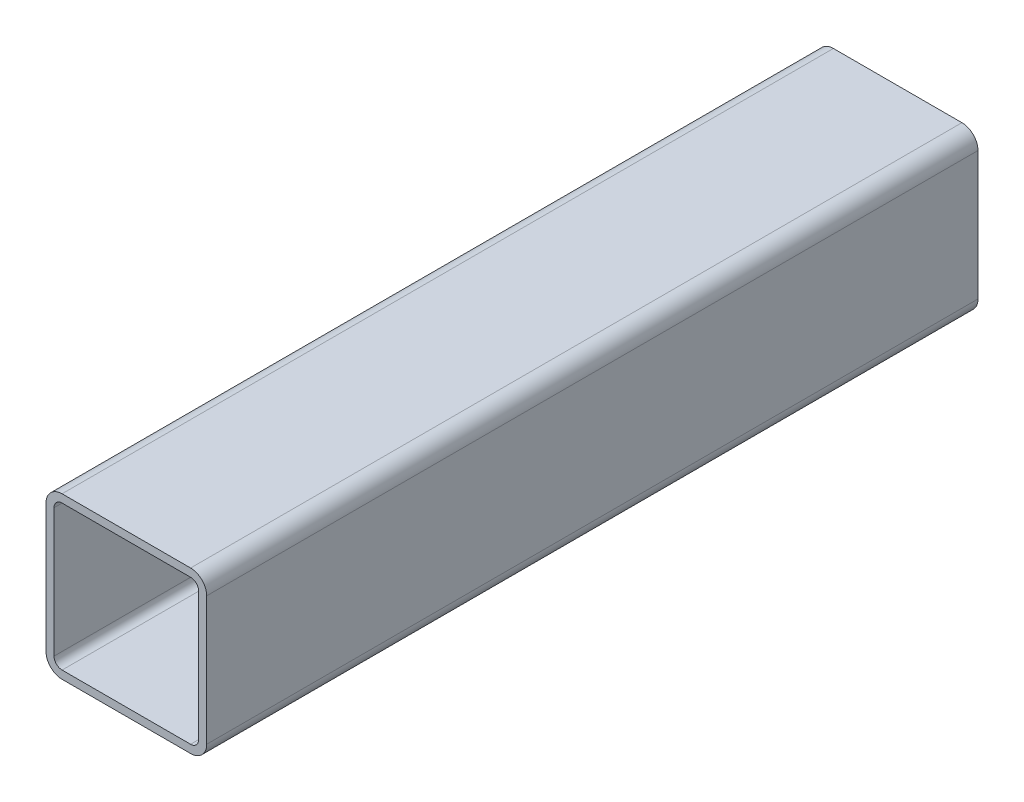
ISO-10303-21;
HEADER;
FILE_DESCRIPTION(('STEP AP214'),'2;1');
FILE_NAME('part.step','',(''),(''),'','','');
FILE_SCHEMA(('AUTOMOTIVE_DESIGN { 1 0 10303 214 1 1 1 1 }'));
ENDSEC;
DATA;
#1=APPLICATION_CONTEXT('core data for automotive mechanical design processes');
#2=APPLICATION_PROTOCOL_DEFINITION('international standard','automotive_design',2000,#1);
#3=PRODUCT_CONTEXT('',#1,'mechanical');
#4=PRODUCT('Part','Part','',(#3));
#5=PRODUCT_RELATED_PRODUCT_CATEGORY('part','',(#4));
#6=PRODUCT_DEFINITION_FORMATION('','',#4);
#7=PRODUCT_DEFINITION_CONTEXT('part definition',#1,'design');
#8=PRODUCT_DEFINITION('design','',#6,#7);
#9=PRODUCT_DEFINITION_SHAPE('','',#8);
#10=(LENGTH_UNIT() NAMED_UNIT(*) SI_UNIT(.MILLI.,.METRE.));
#11=(NAMED_UNIT(*) PLANE_ANGLE_UNIT() SI_UNIT($,.RADIAN.));
#12=(NAMED_UNIT(*) SI_UNIT($,.STERADIAN.) SOLID_ANGLE_UNIT());
#13=UNCERTAINTY_MEASURE_WITH_UNIT(LENGTH_MEASURE(1.E-05),#10,'distance_accuracy_value','');
#14=(GEOMETRIC_REPRESENTATION_CONTEXT(3) GLOBAL_UNCERTAINTY_ASSIGNED_CONTEXT((#13)) GLOBAL_UNIT_ASSIGNED_CONTEXT((#10,
#11,#12)) REPRESENTATION_CONTEXT('',''));
#15=CARTESIAN_POINT('',(0.,0.,0.));
#16=DIRECTION('',(0.,0.,1.));
#17=DIRECTION('',(1.,0.,0.));
#18=AXIS2_PLACEMENT_3D('',#15,#16,#17);
#19=CARTESIAN_POINT('',(9.24608514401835,57.974418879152,304.8));
#20=DIRECTION('',(0.,0.,1.));
#21=DIRECTION('',(1.,0.,0.));
#22=AXIS2_PLACEMENT_3D('',#19,#20,#21);
#23=PLANE('',#22);
#24=CARTESIAN_POINT('',(9.24608514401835,57.974418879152,304.8));
#25=DIRECTION('',(0.,0.,1.));
#26=DIRECTION('',(1.,0.,0.));
#27=AXIS2_PLACEMENT_3D('',#24,#25,#26);
#28=CIRCLE('',#27,6.35000000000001);
#29=CARTESIAN_POINT('',(9.24608514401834,64.324418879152,304.8));
#30=VERTEX_POINT('',#29);
#31=CARTESIAN_POINT('',(2.89608514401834,57.974418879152,304.8));
#32=VERTEX_POINT('',#31);
#33=EDGE_CURVE('E211',#30,#32,#28,.T.);
#34=ORIENTED_EDGE('',*,*,#33,.T.);
#35=DIRECTION('',(0.,-1.,0.));
#36=VECTOR('',#35,1.);
#37=CARTESIAN_POINT('',(2.89608514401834,7.17441887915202,304.8));
#38=LINE('',#37,#36);
#39=CARTESIAN_POINT('',(2.89608514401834,7.17441887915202,304.8));
#40=VERTEX_POINT('',#39);
#41=EDGE_CURVE('E214',#32,#40,#38,.T.);
#42=ORIENTED_EDGE('',*,*,#41,.T.);
#43=CARTESIAN_POINT('',(9.24608514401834,7.17441887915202,304.8));
#44=DIRECTION('',(0.,0.,1.));
#45=DIRECTION('',(1.,0.,0.));
#46=AXIS2_PLACEMENT_3D('',#43,#44,#45);
#47=CIRCLE('',#46,6.35);
#48=CARTESIAN_POINT('',(9.24608514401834,0.824418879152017,304.8));
#49=VERTEX_POINT('',#48);
#50=EDGE_CURVE('E217',#40,#49,#47,.T.);
#51=ORIENTED_EDGE('',*,*,#50,.T.);
#52=DIRECTION('',(1.,0.,0.));
#53=VECTOR('',#52,1.);
#54=CARTESIAN_POINT('',(60.0460851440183,0.824418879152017,304.8));
#55=LINE('',#54,#53);
#56=CARTESIAN_POINT('',(60.0460851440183,0.824418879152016,304.8));
#57=VERTEX_POINT('',#56);
#58=EDGE_CURVE('E219',#49,#57,#55,.T.);
#59=ORIENTED_EDGE('',*,*,#58,.T.);
#60=CARTESIAN_POINT('',(60.0460851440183,7.17441887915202,304.8));
#61=DIRECTION('',(0.,0.,1.));
#62=DIRECTION('',(1.,0.,0.));
#63=AXIS2_PLACEMENT_3D('',#60,#61,#62);
#64=CIRCLE('',#63,6.35);
#65=CARTESIAN_POINT('',(66.3960851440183,7.17441887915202,304.8));
#66=VERTEX_POINT('',#65);
#67=EDGE_CURVE('E221',#57,#66,#64,.T.);
#68=ORIENTED_EDGE('',*,*,#67,.T.);
#69=DIRECTION('',(0.,1.,0.));
#70=VECTOR('',#69,1.);
#71=CARTESIAN_POINT('',(66.3960851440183,57.974418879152,304.8));
#72=LINE('',#71,#70);
#73=CARTESIAN_POINT('',(66.3960851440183,57.974418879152,304.8));
#74=VERTEX_POINT('',#73);
#75=EDGE_CURVE('E223',#66,#74,#72,.T.);
#76=ORIENTED_EDGE('',*,*,#75,.T.);
#77=CARTESIAN_POINT('',(60.0460851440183,57.974418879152,304.8));
#78=DIRECTION('',(0.,0.,1.));
#79=DIRECTION('',(1.,0.,0.));
#80=AXIS2_PLACEMENT_3D('',#77,#78,#79);
#81=CIRCLE('',#80,6.35);
#82=CARTESIAN_POINT('',(60.0460851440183,64.324418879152,304.8));
#83=VERTEX_POINT('',#82);
#84=EDGE_CURVE('E225',#74,#83,#81,.T.);
#85=ORIENTED_EDGE('',*,*,#84,.T.);
#86=DIRECTION('',(-1.,0.,0.));
#87=VECTOR('',#86,1.);
#88=CARTESIAN_POINT('',(9.24608514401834,64.324418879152,304.8));
#89=LINE('',#88,#87);
#90=EDGE_CURVE('E227',#83,#30,#89,.T.);
#91=ORIENTED_EDGE('',*,*,#90,.T.);
#92=EDGE_LOOP('',(#34,#42,#51,#59,#68,#76,#85,#91));
#93=FACE_BOUND('',#92,.T.);
#94=DIRECTION('',(0.,-1.,0.));
#95=VECTOR('',#94,1.);
#96=CARTESIAN_POINT('',(6.07108514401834,7.17441887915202,304.8));
#97=LINE('',#96,#95);
#98=CARTESIAN_POINT('',(6.07108514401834,57.974418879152,304.8));
#99=VERTEX_POINT('',#98);
#100=CARTESIAN_POINT('',(6.07108514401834,7.17441887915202,304.8));
#101=VERTEX_POINT('',#100);
#102=EDGE_CURVE('E154',#99,#101,#97,.T.);
#103=ORIENTED_EDGE('',*,*,#102,.F.);
#104=CARTESIAN_POINT('',(9.24608514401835,57.974418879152,304.8));
#105=DIRECTION('',(0.,0.,1.));
#106=DIRECTION('',(1.,0.,0.));
#107=AXIS2_PLACEMENT_3D('',#104,#105,#106);
#108=CIRCLE('',#107,3.175);
#109=CARTESIAN_POINT('',(9.24608514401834,61.149418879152,304.8));
#110=VERTEX_POINT('',#109);
#111=EDGE_CURVE('E146',#110,#99,#108,.T.);
#112=ORIENTED_EDGE('',*,*,#111,.F.);
#113=DIRECTION('',(-1.,0.,0.));
#114=VECTOR('',#113,1.);
#115=CARTESIAN_POINT('',(9.24608514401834,61.149418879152,304.8));
#116=LINE('',#115,#114);
#117=CARTESIAN_POINT('',(60.0460851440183,61.149418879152,304.8));
#118=VERTEX_POINT('',#117);
#119=EDGE_CURVE('E179',#118,#110,#116,.T.);
#120=ORIENTED_EDGE('',*,*,#119,.F.);
#121=CARTESIAN_POINT('',(60.0460851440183,57.974418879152,304.8));
#122=DIRECTION('',(0.,0.,1.));
#123=DIRECTION('',(1.,0.,0.));
#124=AXIS2_PLACEMENT_3D('',#121,#122,#123);
#125=CIRCLE('',#124,3.175);
#126=CARTESIAN_POINT('',(63.2210851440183,57.974418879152,304.8));
#127=VERTEX_POINT('',#126);
#128=EDGE_CURVE('E177',#127,#118,#125,.T.);
#129=ORIENTED_EDGE('',*,*,#128,.F.);
#130=DIRECTION('',(0.,1.,0.));
#131=VECTOR('',#130,1.);
#132=CARTESIAN_POINT('',(63.2210851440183,57.974418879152,304.8));
#133=LINE('',#132,#131);
#134=CARTESIAN_POINT('',(63.2210851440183,7.17441887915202,304.8));
#135=VERTEX_POINT('',#134);
#136=EDGE_CURVE('E175',#135,#127,#133,.T.);
#137=ORIENTED_EDGE('',*,*,#136,.F.);
#138=CARTESIAN_POINT('',(60.0460851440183,7.17441887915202,304.8));
#139=DIRECTION('',(0.,0.,1.));
#140=DIRECTION('',(1.,0.,0.));
#141=AXIS2_PLACEMENT_3D('',#138,#139,#140);
#142=CIRCLE('',#141,3.175);
#143=CARTESIAN_POINT('',(60.0460851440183,3.99941887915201,304.8));
#144=VERTEX_POINT('',#143);
#145=EDGE_CURVE('E173',#144,#135,#142,.T.);
#146=ORIENTED_EDGE('',*,*,#145,.F.);
#147=DIRECTION('',(1.,0.,0.));
#148=VECTOR('',#147,1.);
#149=CARTESIAN_POINT('',(60.0460851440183,3.99941887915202,304.8));
#150=LINE('',#149,#148);
#151=CARTESIAN_POINT('',(9.24608514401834,3.99941887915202,304.8));
#152=VERTEX_POINT('',#151);
#153=EDGE_CURVE('E169',#152,#144,#150,.T.);
#154=ORIENTED_EDGE('',*,*,#153,.F.);
#155=CARTESIAN_POINT('',(9.24608514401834,7.17441887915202,304.8));
#156=DIRECTION('',(0.,0.,1.));
#157=DIRECTION('',(1.,0.,0.));
#158=AXIS2_PLACEMENT_3D('',#155,#156,#157);
#159=CIRCLE('',#158,3.175);
#160=EDGE_CURVE('E167',#101,#152,#159,.T.);
#161=ORIENTED_EDGE('',*,*,#160,.F.);
#162=EDGE_LOOP('',(#103,#112,#120,#129,#137,#146,#154,#161));
#163=FACE_BOUND('',#162,.T.);
#164=ADVANCED_FACE('F33',(#93,#163),#23,.T.);
#165=CARTESIAN_POINT('',(9.24608514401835,57.974418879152,0.));
#166=DIRECTION('',(0.,0.,1.));
#167=DIRECTION('',(1.,0.,0.));
#168=AXIS2_PLACEMENT_3D('',#165,#166,#167);
#169=PLANE('',#168);
#170=CARTESIAN_POINT('',(9.24608514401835,57.974418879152,0.));
#171=DIRECTION('',(0.,0.,1.));
#172=DIRECTION('',(1.,0.,0.));
#173=AXIS2_PLACEMENT_3D('',#170,#171,#172);
#174=CIRCLE('',#173,6.35000000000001);
#175=CARTESIAN_POINT('',(9.24608514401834,64.324418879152,0.));
#176=VERTEX_POINT('',#175);
#177=CARTESIAN_POINT('',(2.89608514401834,57.974418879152,0.));
#178=VERTEX_POINT('',#177);
#179=EDGE_CURVE('E162',#176,#178,#174,.T.);
#180=ORIENTED_EDGE('',*,*,#179,.F.);
#181=DIRECTION('',(-1.,0.,0.));
#182=VECTOR('',#181,1.);
#183=CARTESIAN_POINT('',(9.24608514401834,64.324418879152,0.));
#184=LINE('',#183,#182);
#185=CARTESIAN_POINT('',(60.0460851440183,64.324418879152,0.));
#186=VERTEX_POINT('',#185);
#187=EDGE_CURVE('E215',#186,#176,#184,.T.);
#188=ORIENTED_EDGE('',*,*,#187,.F.);
#189=CARTESIAN_POINT('',(60.0460851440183,57.974418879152,0.));
#190=DIRECTION('',(0.,0.,1.));
#191=DIRECTION('',(1.,0.,0.));
#192=AXIS2_PLACEMENT_3D('',#189,#190,#191);
#193=CIRCLE('',#192,6.35);
#194=CARTESIAN_POINT('',(66.3960851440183,57.974418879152,0.));
#195=VERTEX_POINT('',#194);
#196=EDGE_CURVE('E242',#195,#186,#193,.T.);
#197=ORIENTED_EDGE('',*,*,#196,.F.);
#198=DIRECTION('',(0.,1.,0.));
#199=VECTOR('',#198,1.);
#200=CARTESIAN_POINT('',(66.3960851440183,57.974418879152,0.));
#201=LINE('',#200,#199);
#202=CARTESIAN_POINT('',(66.3960851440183,7.17441887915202,0.));
#203=VERTEX_POINT('',#202);
#204=EDGE_CURVE('E240',#203,#195,#201,.T.);
#205=ORIENTED_EDGE('',*,*,#204,.F.);
#206=CARTESIAN_POINT('',(60.0460851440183,7.17441887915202,0.));
#207=DIRECTION('',(0.,0.,1.));
#208=DIRECTION('',(1.,0.,0.));
#209=AXIS2_PLACEMENT_3D('',#206,#207,#208);
#210=CIRCLE('',#209,6.35);
#211=CARTESIAN_POINT('',(60.0460851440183,0.824418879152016,0.));
#212=VERTEX_POINT('',#211);
#213=EDGE_CURVE('E238',#212,#203,#210,.T.);
#214=ORIENTED_EDGE('',*,*,#213,.F.);
#215=DIRECTION('',(1.,0.,0.));
#216=VECTOR('',#215,1.);
#217=CARTESIAN_POINT('',(60.0460851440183,0.824418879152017,0.));
#218=LINE('',#217,#216);
#219=CARTESIAN_POINT('',(9.24608514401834,0.824418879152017,0.));
#220=VERTEX_POINT('',#219);
#221=EDGE_CURVE('E236',#220,#212,#218,.T.);
#222=ORIENTED_EDGE('',*,*,#221,.F.);
#223=CARTESIAN_POINT('',(9.24608514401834,7.17441887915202,0.));
#224=DIRECTION('',(0.,0.,1.));
#225=DIRECTION('',(1.,0.,0.));
#226=AXIS2_PLACEMENT_3D('',#223,#224,#225);
#227=CIRCLE('',#226,6.35);
#228=CARTESIAN_POINT('',(2.89608514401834,7.17441887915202,0.));
#229=VERTEX_POINT('',#228);
#230=EDGE_CURVE('E234',#229,#220,#227,.T.);
#231=ORIENTED_EDGE('',*,*,#230,.F.);
#232=DIRECTION('',(0.,-1.,0.));
#233=VECTOR('',#232,1.);
#234=CARTESIAN_POINT('',(2.89608514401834,7.17441887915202,0.));
#235=LINE('',#234,#233);
#236=EDGE_CURVE('E232',#178,#229,#235,.T.);
#237=ORIENTED_EDGE('',*,*,#236,.F.);
#238=EDGE_LOOP('',(#180,#188,#197,#205,#214,#222,#231,#237));
#239=FACE_BOUND('',#238,.T.);
#240=CARTESIAN_POINT('',(9.24608514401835,57.974418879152,0.));
#241=DIRECTION('',(0.,0.,1.));
#242=DIRECTION('',(1.,0.,0.));
#243=AXIS2_PLACEMENT_3D('',#240,#241,#242);
#244=CIRCLE('',#243,3.175);
#245=CARTESIAN_POINT('',(9.24608514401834,61.149418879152,0.));
#246=VERTEX_POINT('',#245);
#247=CARTESIAN_POINT('',(6.07108514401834,57.974418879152,0.));
#248=VERTEX_POINT('',#247);
#249=EDGE_CURVE('E56',#246,#248,#244,.T.);
#250=ORIENTED_EDGE('',*,*,#249,.T.);
#251=DIRECTION('',(0.,-1.,0.));
#252=VECTOR('',#251,1.);
#253=CARTESIAN_POINT('',(6.07108514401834,7.17441887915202,0.));
#254=LINE('',#253,#252);
#255=CARTESIAN_POINT('',(6.07108514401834,7.17441887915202,0.));
#256=VERTEX_POINT('',#255);
#257=EDGE_CURVE('E161',#248,#256,#254,.T.);
#258=ORIENTED_EDGE('',*,*,#257,.T.);
#259=CARTESIAN_POINT('',(9.24608514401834,7.17441887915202,0.));
#260=DIRECTION('',(0.,0.,1.));
#261=DIRECTION('',(1.,0.,0.));
#262=AXIS2_PLACEMENT_3D('',#259,#260,#261);
#263=CIRCLE('',#262,3.175);
#264=CARTESIAN_POINT('',(9.24608514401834,3.99941887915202,0.));
#265=VERTEX_POINT('',#264);
#266=EDGE_CURVE('E183',#256,#265,#263,.T.);
#267=ORIENTED_EDGE('',*,*,#266,.T.);
#268=DIRECTION('',(1.,0.,0.));
#269=VECTOR('',#268,1.);
#270=CARTESIAN_POINT('',(60.0460851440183,3.99941887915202,0.));
#271=LINE('',#270,#269);
#272=CARTESIAN_POINT('',(60.0460851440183,3.99941887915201,0.));
#273=VERTEX_POINT('',#272);
#274=EDGE_CURVE('E186',#265,#273,#271,.T.);
#275=ORIENTED_EDGE('',*,*,#274,.T.);
#276=CARTESIAN_POINT('',(60.0460851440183,7.17441887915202,0.));
#277=DIRECTION('',(0.,0.,1.));
#278=DIRECTION('',(1.,0.,0.));
#279=AXIS2_PLACEMENT_3D('',#276,#277,#278);
#280=CIRCLE('',#279,3.175);
#281=CARTESIAN_POINT('',(63.2210851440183,7.17441887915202,0.));
#282=VERTEX_POINT('',#281);
#283=EDGE_CURVE('E189',#273,#282,#280,.T.);
#284=ORIENTED_EDGE('',*,*,#283,.T.);
#285=DIRECTION('',(0.,1.,0.));
#286=VECTOR('',#285,1.);
#287=CARTESIAN_POINT('',(63.2210851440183,57.974418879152,0.));
#288=LINE('',#287,#286);
#289=CARTESIAN_POINT('',(63.2210851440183,57.974418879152,0.));
#290=VERTEX_POINT('',#289);
#291=EDGE_CURVE('E192',#282,#290,#288,.T.);
#292=ORIENTED_EDGE('',*,*,#291,.T.);
#293=CARTESIAN_POINT('',(60.0460851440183,57.974418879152,0.));
#294=DIRECTION('',(0.,0.,1.));
#295=DIRECTION('',(1.,0.,0.));
#296=AXIS2_PLACEMENT_3D('',#293,#294,#295);
#297=CIRCLE('',#296,3.175);
#298=CARTESIAN_POINT('',(60.0460851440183,61.149418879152,0.));
#299=VERTEX_POINT('',#298);
#300=EDGE_CURVE('E195',#290,#299,#297,.T.);
#301=ORIENTED_EDGE('',*,*,#300,.T.);
#302=DIRECTION('',(-1.,0.,0.));
#303=VECTOR('',#302,1.);
#304=CARTESIAN_POINT('',(9.24608514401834,61.149418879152,0.));
#305=LINE('',#304,#303);
#306=EDGE_CURVE('E155',#299,#246,#305,.T.);
#307=ORIENTED_EDGE('',*,*,#306,.T.);
#308=EDGE_LOOP('',(#250,#258,#267,#275,#284,#292,#301,#307));
#309=FACE_BOUND('',#308,.T.);
#310=ADVANCED_FACE('F272',(#239,#309),#169,.F.);
#311=CARTESIAN_POINT('',(9.24608514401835,57.974418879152,304.8));
#312=DIRECTION('',(0.,0.,-1.));
#313=DIRECTION('',(-1.,0.,0.));
#314=AXIS2_PLACEMENT_3D('',#311,#312,#313);
#315=CYLINDRICAL_SURFACE('',#314,6.35000000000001);
#316=ORIENTED_EDGE('',*,*,#179,.T.);
#317=DIRECTION('',(0.,0.,-1.));
#318=VECTOR('',#317,1.);
#319=CARTESIAN_POINT('',(2.89608514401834,57.974418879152,304.8));
#320=LINE('',#319,#318);
#321=EDGE_CURVE('E11',#32,#178,#320,.T.);
#322=ORIENTED_EDGE('',*,*,#321,.F.);
#323=ORIENTED_EDGE('',*,*,#33,.F.);
#324=DIRECTION('',(0.,0.,-1.));
#325=VECTOR('',#324,1.);
#326=CARTESIAN_POINT('',(9.24608514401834,64.324418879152,304.8));
#327=LINE('',#326,#325);
#328=EDGE_CURVE('E229',#30,#176,#327,.T.);
#329=ORIENTED_EDGE('',*,*,#328,.T.);
#330=EDGE_LOOP('',(#316,#322,#323,#329));
#331=FACE_BOUND('',#330,.T.);
#332=ADVANCED_FACE('F35',(#331),#315,.T.);
#333=CARTESIAN_POINT('',(2.89608514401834,7.17441887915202,304.8));
#334=DIRECTION('',(1.,0.,0.));
#335=DIRECTION('',(0.,0.,-1.));
#336=AXIS2_PLACEMENT_3D('',#333,#334,#335);
#337=PLANE('',#336);
#338=ORIENTED_EDGE('',*,*,#236,.T.);
#339=DIRECTION('',(0.,0.,-1.));
#340=VECTOR('',#339,1.);
#341=CARTESIAN_POINT('',(2.89608514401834,7.17441887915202,304.8));
#342=LINE('',#341,#340);
#343=EDGE_CURVE('E41',#40,#229,#342,.T.);
#344=ORIENTED_EDGE('',*,*,#343,.F.);
#345=ORIENTED_EDGE('',*,*,#41,.F.);
#346=ORIENTED_EDGE('',*,*,#321,.T.);
#347=EDGE_LOOP('',(#338,#344,#345,#346));
#348=FACE_BOUND('',#347,.T.);
#349=ADVANCED_FACE('F289',(#348),#337,.F.);
#350=CARTESIAN_POINT('',(9.24608514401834,7.17441887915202,304.8));
#351=DIRECTION('',(0.,0.,-1.));
#352=DIRECTION('',(-1.,0.,0.));
#353=AXIS2_PLACEMENT_3D('',#350,#351,#352);
#354=CYLINDRICAL_SURFACE('',#353,6.35);
#355=ORIENTED_EDGE('',*,*,#230,.T.);
#356=DIRECTION('',(0.,0.,-1.));
#357=VECTOR('',#356,1.);
#358=CARTESIAN_POINT('',(9.24608514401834,0.824418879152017,304.8));
#359=LINE('',#358,#357);
#360=EDGE_CURVE('E259',#49,#220,#359,.T.);
#361=ORIENTED_EDGE('',*,*,#360,.F.);
#362=ORIENTED_EDGE('',*,*,#50,.F.);
#363=ORIENTED_EDGE('',*,*,#343,.T.);
#364=EDGE_LOOP('',(#355,#361,#362,#363));
#365=FACE_BOUND('',#364,.T.);
#366=ADVANCED_FACE('F266',(#365),#354,.T.);
#367=CARTESIAN_POINT('',(60.0460851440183,0.824418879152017,304.8));
#368=DIRECTION('',(0.,1.,0.));
#369=DIRECTION('',(0.,0.,1.));
#370=AXIS2_PLACEMENT_3D('',#367,#368,#369);
#371=PLANE('',#370);
#372=ORIENTED_EDGE('',*,*,#221,.T.);
#373=DIRECTION('',(0.,0.,-1.));
#374=VECTOR('',#373,1.);
#375=CARTESIAN_POINT('',(60.0460851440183,0.824418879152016,304.8));
#376=LINE('',#375,#374);
#377=EDGE_CURVE('E256',#57,#212,#376,.T.);
#378=ORIENTED_EDGE('',*,*,#377,.F.);
#379=ORIENTED_EDGE('',*,*,#58,.F.);
#380=ORIENTED_EDGE('',*,*,#360,.T.);
#381=EDGE_LOOP('',(#372,#378,#379,#380));
#382=FACE_BOUND('',#381,.T.);
#383=ADVANCED_FACE('F278',(#382),#371,.F.);
#384=CARTESIAN_POINT('',(60.0460851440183,7.17441887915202,304.8));
#385=DIRECTION('',(0.,0.,-1.));
#386=DIRECTION('',(-1.,0.,0.));
#387=AXIS2_PLACEMENT_3D('',#384,#385,#386);
#388=CYLINDRICAL_SURFACE('',#387,6.35);
#389=ORIENTED_EDGE('',*,*,#213,.T.);
#390=DIRECTION('',(0.,0.,-1.));
#391=VECTOR('',#390,1.);
#392=CARTESIAN_POINT('',(66.3960851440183,7.17441887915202,304.8));
#393=LINE('',#392,#391);
#394=EDGE_CURVE('E253',#66,#203,#393,.T.);
#395=ORIENTED_EDGE('',*,*,#394,.F.);
#396=ORIENTED_EDGE('',*,*,#67,.F.);
#397=ORIENTED_EDGE('',*,*,#377,.T.);
#398=EDGE_LOOP('',(#389,#395,#396,#397));
#399=FACE_BOUND('',#398,.T.);
#400=ADVANCED_FACE('F282',(#399),#388,.T.);
#401=CARTESIAN_POINT('',(66.3960851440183,57.974418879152,304.8));
#402=DIRECTION('',(-1.,0.,0.));
#403=DIRECTION('',(0.,0.,1.));
#404=AXIS2_PLACEMENT_3D('',#401,#402,#403);
#405=PLANE('',#404);
#406=ORIENTED_EDGE('',*,*,#204,.T.);
#407=DIRECTION('',(0.,0.,-1.));
#408=VECTOR('',#407,1.);
#409=CARTESIAN_POINT('',(66.3960851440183,57.974418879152,304.8));
#410=LINE('',#409,#408);
#411=EDGE_CURVE('E250',#74,#195,#410,.T.);
#412=ORIENTED_EDGE('',*,*,#411,.F.);
#413=ORIENTED_EDGE('',*,*,#75,.F.);
#414=ORIENTED_EDGE('',*,*,#394,.T.);
#415=EDGE_LOOP('',(#406,#412,#413,#414));
#416=FACE_BOUND('',#415,.T.);
#417=ADVANCED_FACE('F302',(#416),#405,.F.);
#418=CARTESIAN_POINT('',(60.0460851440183,57.974418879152,304.8));
#419=DIRECTION('',(0.,0.,-1.));
#420=DIRECTION('',(-1.,0.,0.));
#421=AXIS2_PLACEMENT_3D('',#418,#419,#420);
#422=CYLINDRICAL_SURFACE('',#421,6.35);
#423=ORIENTED_EDGE('',*,*,#196,.T.);
#424=DIRECTION('',(0.,0.,-1.));
#425=VECTOR('',#424,1.);
#426=CARTESIAN_POINT('',(60.0460851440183,64.324418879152,304.8));
#427=LINE('',#426,#425);
#428=EDGE_CURVE('E247',#83,#186,#427,.T.);
#429=ORIENTED_EDGE('',*,*,#428,.F.);
#430=ORIENTED_EDGE('',*,*,#84,.F.);
#431=ORIENTED_EDGE('',*,*,#411,.T.);
#432=EDGE_LOOP('',(#423,#429,#430,#431));
#433=FACE_BOUND('',#432,.T.);
#434=ADVANCED_FACE('F300',(#433),#422,.T.);
#435=CARTESIAN_POINT('',(9.24608514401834,64.324418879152,304.8));
#436=DIRECTION('',(0.,-1.,0.));
#437=DIRECTION('',(0.,0.,-1.));
#438=AXIS2_PLACEMENT_3D('',#435,#436,#437);
#439=PLANE('',#438);
#440=ORIENTED_EDGE('',*,*,#187,.T.);
#441=ORIENTED_EDGE('',*,*,#328,.F.);
#442=ORIENTED_EDGE('',*,*,#90,.F.);
#443=ORIENTED_EDGE('',*,*,#428,.T.);
#444=EDGE_LOOP('',(#440,#441,#442,#443));
#445=FACE_BOUND('',#444,.T.);
#446=ADVANCED_FACE('F295',(#445),#439,.F.);
#447=CARTESIAN_POINT('',(9.24608514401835,57.974418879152,304.8));
#448=DIRECTION('',(0.,0.,-1.));
#449=DIRECTION('',(-1.,0.,0.));
#450=AXIS2_PLACEMENT_3D('',#447,#448,#449);
#451=CYLINDRICAL_SURFACE('',#450,3.175);
#452=ORIENTED_EDGE('',*,*,#249,.F.);
#453=DIRECTION('',(0.,0.,-1.));
#454=VECTOR('',#453,1.);
#455=CARTESIAN_POINT('',(9.24608514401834,61.149418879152,304.8));
#456=LINE('',#455,#454);
#457=EDGE_CURVE('E150',#110,#246,#456,.T.);
#458=ORIENTED_EDGE('',*,*,#457,.F.);
#459=ORIENTED_EDGE('',*,*,#111,.T.);
#460=DIRECTION('',(0.,0.,-1.));
#461=VECTOR('',#460,1.);
#462=CARTESIAN_POINT('',(6.07108514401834,57.974418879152,304.8));
#463=LINE('',#462,#461);
#464=EDGE_CURVE('E149',#99,#248,#463,.T.);
#465=ORIENTED_EDGE('',*,*,#464,.T.);
#466=EDGE_LOOP('',(#452,#458,#459,#465));
#467=FACE_BOUND('',#466,.T.);
#468=ADVANCED_FACE('F148',(#467),#451,.F.);
#469=CARTESIAN_POINT('',(6.07108514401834,7.17441887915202,304.8));
#470=DIRECTION('',(1.,0.,0.));
#471=DIRECTION('',(0.,0.,-1.));
#472=AXIS2_PLACEMENT_3D('',#469,#470,#471);
#473=PLANE('',#472);
#474=ORIENTED_EDGE('',*,*,#257,.F.);
#475=ORIENTED_EDGE('',*,*,#464,.F.);
#476=ORIENTED_EDGE('',*,*,#102,.T.);
#477=DIRECTION('',(0.,0.,-1.));
#478=VECTOR('',#477,1.);
#479=CARTESIAN_POINT('',(6.07108514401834,7.17441887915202,304.8));
#480=LINE('',#479,#478);
#481=EDGE_CURVE('E163',#101,#256,#480,.T.);
#482=ORIENTED_EDGE('',*,*,#481,.T.);
#483=EDGE_LOOP('',(#474,#475,#476,#482));
#484=FACE_BOUND('',#483,.T.);
#485=ADVANCED_FACE('F158',(#484),#473,.T.);
#486=CARTESIAN_POINT('',(9.24608514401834,7.17441887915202,304.8));
#487=DIRECTION('',(0.,0.,-1.));
#488=DIRECTION('',(-1.,0.,0.));
#489=AXIS2_PLACEMENT_3D('',#486,#487,#488);
#490=CYLINDRICAL_SURFACE('',#489,3.175);
#491=ORIENTED_EDGE('',*,*,#266,.F.);
#492=ORIENTED_EDGE('',*,*,#481,.F.);
#493=ORIENTED_EDGE('',*,*,#160,.T.);
#494=DIRECTION('',(0.,0.,-1.));
#495=VECTOR('',#494,1.);
#496=CARTESIAN_POINT('',(9.24608514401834,3.99941887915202,304.8));
#497=LINE('',#496,#495);
#498=EDGE_CURVE('E208',#152,#265,#497,.T.);
#499=ORIENTED_EDGE('',*,*,#498,.T.);
#500=EDGE_LOOP('',(#491,#492,#493,#499));
#501=FACE_BOUND('',#500,.T.);
#502=ADVANCED_FACE('F327',(#501),#490,.F.);
#503=CARTESIAN_POINT('',(60.0460851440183,3.99941887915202,304.8));
#504=DIRECTION('',(0.,1.,0.));
#505=DIRECTION('',(0.,0.,1.));
#506=AXIS2_PLACEMENT_3D('',#503,#504,#505);
#507=PLANE('',#506);
#508=ORIENTED_EDGE('',*,*,#274,.F.);
#509=ORIENTED_EDGE('',*,*,#498,.F.);
#510=ORIENTED_EDGE('',*,*,#153,.T.);
#511=DIRECTION('',(0.,0.,-1.));
#512=VECTOR('',#511,1.);
#513=CARTESIAN_POINT('',(60.0460851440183,3.99941887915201,304.8));
#514=LINE('',#513,#512);
#515=EDGE_CURVE('E206',#144,#273,#514,.T.);
#516=ORIENTED_EDGE('',*,*,#515,.T.);
#517=EDGE_LOOP('',(#508,#509,#510,#516));
#518=FACE_BOUND('',#517,.T.);
#519=ADVANCED_FACE('F331',(#518),#507,.T.);
#520=CARTESIAN_POINT('',(60.0460851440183,7.17441887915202,304.8));
#521=DIRECTION('',(0.,0.,-1.));
#522=DIRECTION('',(-1.,0.,0.));
#523=AXIS2_PLACEMENT_3D('',#520,#521,#522);
#524=CYLINDRICAL_SURFACE('',#523,3.175);
#525=ORIENTED_EDGE('',*,*,#283,.F.);
#526=ORIENTED_EDGE('',*,*,#515,.F.);
#527=ORIENTED_EDGE('',*,*,#145,.T.);
#528=DIRECTION('',(0.,0.,-1.));
#529=VECTOR('',#528,1.);
#530=CARTESIAN_POINT('',(63.2210851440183,7.17441887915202,304.8));
#531=LINE('',#530,#529);
#532=EDGE_CURVE('E204',#135,#282,#531,.T.);
#533=ORIENTED_EDGE('',*,*,#532,.T.);
#534=EDGE_LOOP('',(#525,#526,#527,#533));
#535=FACE_BOUND('',#534,.T.);
#536=ADVANCED_FACE('F337',(#535),#524,.F.);
#537=CARTESIAN_POINT('',(63.2210851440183,57.974418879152,304.8));
#538=DIRECTION('',(-1.,0.,0.));
#539=DIRECTION('',(0.,0.,1.));
#540=AXIS2_PLACEMENT_3D('',#537,#538,#539);
#541=PLANE('',#540);
#542=ORIENTED_EDGE('',*,*,#291,.F.);
#543=ORIENTED_EDGE('',*,*,#532,.F.);
#544=ORIENTED_EDGE('',*,*,#136,.T.);
#545=DIRECTION('',(0.,0.,-1.));
#546=VECTOR('',#545,1.);
#547=CARTESIAN_POINT('',(63.2210851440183,57.974418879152,304.8));
#548=LINE('',#547,#546);
#549=EDGE_CURVE('E202',#127,#290,#548,.T.);
#550=ORIENTED_EDGE('',*,*,#549,.T.);
#551=EDGE_LOOP('',(#542,#543,#544,#550));
#552=FACE_BOUND('',#551,.T.);
#553=ADVANCED_FACE('F341',(#552),#541,.T.);
#554=CARTESIAN_POINT('',(60.0460851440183,57.974418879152,304.8));
#555=DIRECTION('',(0.,0.,-1.));
#556=DIRECTION('',(-1.,0.,0.));
#557=AXIS2_PLACEMENT_3D('',#554,#555,#556);
#558=CYLINDRICAL_SURFACE('',#557,3.175);
#559=ORIENTED_EDGE('',*,*,#300,.F.);
#560=ORIENTED_EDGE('',*,*,#549,.F.);
#561=ORIENTED_EDGE('',*,*,#128,.T.);
#562=DIRECTION('',(0.,0.,-1.));
#563=VECTOR('',#562,1.);
#564=CARTESIAN_POINT('',(60.0460851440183,61.149418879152,304.8));
#565=LINE('',#564,#563);
#566=EDGE_CURVE('E48',#118,#299,#565,.T.);
#567=ORIENTED_EDGE('',*,*,#566,.T.);
#568=EDGE_LOOP('',(#559,#560,#561,#567));
#569=FACE_BOUND('',#568,.T.);
#570=ADVANCED_FACE('F345',(#569),#558,.F.);
#571=CARTESIAN_POINT('',(9.24608514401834,61.149418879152,304.8));
#572=DIRECTION('',(0.,-1.,0.));
#573=DIRECTION('',(0.,0.,-1.));
#574=AXIS2_PLACEMENT_3D('',#571,#572,#573);
#575=PLANE('',#574);
#576=ORIENTED_EDGE('',*,*,#306,.F.);
#577=ORIENTED_EDGE('',*,*,#566,.F.);
#578=ORIENTED_EDGE('',*,*,#119,.T.);
#579=ORIENTED_EDGE('',*,*,#457,.T.);
#580=EDGE_LOOP('',(#576,#577,#578,#579));
#581=FACE_BOUND('',#580,.T.);
#582=ADVANCED_FACE('F349',(#581),#575,.T.);
#583=CLOSED_SHELL('',(#164,#310,#332,#349,#366,#383,#400,#417,#434,#446,#468,#485,#502,#519,
#536,#553,#570,#582));
#584=MANIFOLD_SOLID_BREP('B2',#583);
#585=ADVANCED_BREP_SHAPE_REPRESENTATION('',(#18,#584),#14);
#586=SHAPE_DEFINITION_REPRESENTATION(#9,#585);
ENDSEC;
END-ISO-10303-21;
